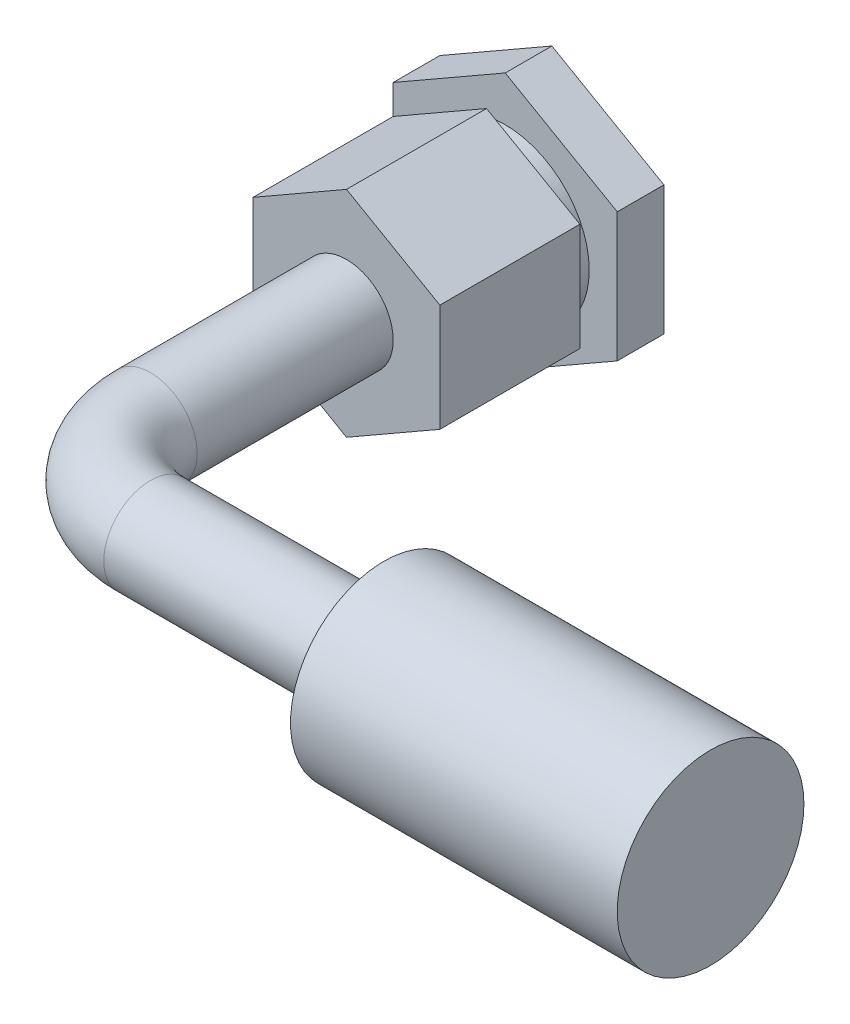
ISO-10303-21;
HEADER;
FILE_DESCRIPTION(('STEP AP214'),'2;1');
FILE_NAME('part.step','',(''),(''),'','','');
FILE_SCHEMA(('AUTOMOTIVE_DESIGN { 1 0 10303 214 1 1 1 1 }'));
ENDSEC;
DATA;
#1=APPLICATION_CONTEXT('core data for automotive mechanical design processes');
#2=APPLICATION_PROTOCOL_DEFINITION('international standard','automotive_design',2000,#1);
#3=PRODUCT_CONTEXT('',#1,'mechanical');
#4=PRODUCT('Part','Part','',(#3));
#5=PRODUCT_RELATED_PRODUCT_CATEGORY('part','',(#4));
#6=PRODUCT_DEFINITION_FORMATION('','',#4);
#7=PRODUCT_DEFINITION_CONTEXT('part definition',#1,'design');
#8=PRODUCT_DEFINITION('design','',#6,#7);
#9=PRODUCT_DEFINITION_SHAPE('','',#8);
#10=(LENGTH_UNIT() NAMED_UNIT(*) SI_UNIT(.MILLI.,.METRE.));
#11=(NAMED_UNIT(*) PLANE_ANGLE_UNIT() SI_UNIT($,.RADIAN.));
#12=(NAMED_UNIT(*) SI_UNIT($,.STERADIAN.) SOLID_ANGLE_UNIT());
#13=UNCERTAINTY_MEASURE_WITH_UNIT(LENGTH_MEASURE(1.E-05),#10,'distance_accuracy_value','');
#14=(GEOMETRIC_REPRESENTATION_CONTEXT(3) GLOBAL_UNCERTAINTY_ASSIGNED_CONTEXT((#13)) GLOBAL_UNIT_ASSIGNED_CONTEXT((#10,
#11,#12)) REPRESENTATION_CONTEXT('',''));
#15=CARTESIAN_POINT('',(0.,0.,0.));
#16=DIRECTION('',(0.,0.,1.));
#17=DIRECTION('',(1.,0.,0.));
#18=AXIS2_PLACEMENT_3D('',#15,#16,#17);
#19=CARTESIAN_POINT('',(-12.,6.91694403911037,5.));
#20=DIRECTION('',(0.,0.,1.));
#21=DIRECTION('',(1.,0.,0.));
#22=AXIS2_PLACEMENT_3D('',#19,#20,#21);
#23=PLANE('',#22);
#24=DIRECTION('',(-0.867435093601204,-0.497550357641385,0.));
#25=VECTOR('',#24,1.);
#26=CARTESIAN_POINT('',(0.,13.8,5.));
#27=LINE('',#26,#25);
#28=CARTESIAN_POINT('',(0.,13.8,5.));
#29=VERTEX_POINT('',#28);
#30=CARTESIAN_POINT('',(-12.,6.91694403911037,5.));
#31=VERTEX_POINT('',#30);
#32=EDGE_CURVE('E206',#29,#31,#27,.T.);
#33=ORIENTED_EDGE('',*,*,#32,.T.);
#34=DIRECTION('',(0.,-1.,0.));
#35=VECTOR('',#34,1.);
#36=CARTESIAN_POINT('',(-12.,6.91694403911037,5.));
#37=LINE('',#36,#35);
#38=CARTESIAN_POINT('',(-12.,-6.91694403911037,5.));
#39=VERTEX_POINT('',#38);
#40=EDGE_CURVE('E208',#31,#39,#37,.T.);
#41=ORIENTED_EDGE('',*,*,#40,.T.);
#42=DIRECTION('',(0.867435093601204,-0.497550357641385,0.));
#43=VECTOR('',#42,1.);
#44=CARTESIAN_POINT('',(0.,-13.8,5.));
#45=LINE('',#44,#43);
#46=CARTESIAN_POINT('',(0.,-13.8,5.));
#47=VERTEX_POINT('',#46);
#48=EDGE_CURVE('E210',#39,#47,#45,.T.);
#49=ORIENTED_EDGE('',*,*,#48,.T.);
#50=DIRECTION('',(0.867435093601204,0.497550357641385,0.));
#51=VECTOR('',#50,1.);
#52=CARTESIAN_POINT('',(0.,-13.8,5.));
#53=LINE('',#52,#51);
#54=CARTESIAN_POINT('',(12.,-6.91694403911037,5.));
#55=VERTEX_POINT('',#54);
#56=EDGE_CURVE('E212',#47,#55,#53,.T.);
#57=ORIENTED_EDGE('',*,*,#56,.T.);
#58=DIRECTION('',(0.,1.,0.));
#59=VECTOR('',#58,1.);
#60=CARTESIAN_POINT('',(12.,6.91694403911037,5.));
#61=LINE('',#60,#59);
#62=CARTESIAN_POINT('',(12.,6.91694403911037,5.));
#63=VERTEX_POINT('',#62);
#64=EDGE_CURVE('E53',#55,#63,#61,.T.);
#65=ORIENTED_EDGE('',*,*,#64,.T.);
#66=DIRECTION('',(-0.867435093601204,0.497550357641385,0.));
#67=VECTOR('',#66,1.);
#68=CARTESIAN_POINT('',(0.,13.8,5.));
#69=LINE('',#68,#67);
#70=EDGE_CURVE('E48',#63,#29,#69,.T.);
#71=ORIENTED_EDGE('',*,*,#70,.T.);
#72=EDGE_LOOP('',(#33,#41,#49,#57,#65,#71));
#73=FACE_BOUND('',#72,.T.);
#74=CARTESIAN_POINT('',(0.,0.,5.));
#75=DIRECTION('',(0.,0.,1.));
#76=DIRECTION('',(1.,0.,0.));
#77=AXIS2_PLACEMENT_3D('',#74,#75,#76);
#78=CIRCLE('',#77,9.);
#79=CARTESIAN_POINT('',(9.,0.,5.));
#80=VERTEX_POINT('',#79);
#81=EDGE_CURVE('E190',#80,#80,#78,.F.);
#82=ORIENTED_EDGE('',*,*,#81,.T.);
#83=EDGE_LOOP('',(#82));
#84=FACE_BOUND('',#83,.T.);
#85=ADVANCED_FACE('F31',(#73,#84),#23,.T.);
#86=CARTESIAN_POINT('',(-12.,6.91694403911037,0.));
#87=DIRECTION('',(0.,0.,1.));
#88=DIRECTION('',(1.,0.,0.));
#89=AXIS2_PLACEMENT_3D('',#86,#87,#88);
#90=PLANE('',#89);
#91=DIRECTION('',(-0.867435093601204,-0.497550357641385,0.));
#92=VECTOR('',#91,1.);
#93=CARTESIAN_POINT('',(0.,13.8,0.));
#94=LINE('',#93,#92);
#95=CARTESIAN_POINT('',(0.,13.8,0.));
#96=VERTEX_POINT('',#95);
#97=CARTESIAN_POINT('',(-12.,6.91694403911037,0.));
#98=VERTEX_POINT('',#97);
#99=EDGE_CURVE('E193',#96,#98,#94,.T.);
#100=ORIENTED_EDGE('',*,*,#99,.F.);
#101=DIRECTION('',(-0.867435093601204,0.497550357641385,0.));
#102=VECTOR('',#101,1.);
#103=CARTESIAN_POINT('',(0.,13.8,0.));
#104=LINE('',#103,#102);
#105=CARTESIAN_POINT('',(12.,6.91694403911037,0.));
#106=VERTEX_POINT('',#105);
#107=EDGE_CURVE('E204',#106,#96,#104,.T.);
#108=ORIENTED_EDGE('',*,*,#107,.F.);
#109=DIRECTION('',(0.,1.,0.));
#110=VECTOR('',#109,1.);
#111=CARTESIAN_POINT('',(12.,6.91694403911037,0.));
#112=LINE('',#111,#110);
#113=CARTESIAN_POINT('',(12.,-6.91694403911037,0.));
#114=VERTEX_POINT('',#113);
#115=EDGE_CURVE('E202',#114,#106,#112,.T.);
#116=ORIENTED_EDGE('',*,*,#115,.F.);
#117=DIRECTION('',(0.867435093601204,0.497550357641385,0.));
#118=VECTOR('',#117,1.);
#119=CARTESIAN_POINT('',(0.,-13.8,0.));
#120=LINE('',#119,#118);
#121=CARTESIAN_POINT('',(0.,-13.8,0.));
#122=VERTEX_POINT('',#121);
#123=EDGE_CURVE('E200',#122,#114,#120,.T.);
#124=ORIENTED_EDGE('',*,*,#123,.F.);
#125=DIRECTION('',(0.867435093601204,-0.497550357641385,0.));
#126=VECTOR('',#125,1.);
#127=CARTESIAN_POINT('',(0.,-13.8,0.));
#128=LINE('',#127,#126);
#129=CARTESIAN_POINT('',(-12.,-6.91694403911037,0.));
#130=VERTEX_POINT('',#129);
#131=EDGE_CURVE('E198',#130,#122,#128,.T.);
#132=ORIENTED_EDGE('',*,*,#131,.F.);
#133=DIRECTION('',(0.,-1.,0.));
#134=VECTOR('',#133,1.);
#135=CARTESIAN_POINT('',(-12.,6.91694403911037,0.));
#136=LINE('',#135,#134);
#137=EDGE_CURVE('E196',#98,#130,#136,.T.);
#138=ORIENTED_EDGE('',*,*,#137,.F.);
#139=EDGE_LOOP('',(#100,#108,#116,#124,#132,#138));
#140=FACE_BOUND('',#139,.T.);
#141=CARTESIAN_POINT('',(0.,0.,0.));
#142=DIRECTION('',(0.,0.,1.));
#143=DIRECTION('',(1.,0.,0.));
#144=AXIS2_PLACEMENT_3D('',#141,#142,#143);
#145=CIRCLE('',#144,9.);
#146=CARTESIAN_POINT('',(9.,0.,0.));
#147=VERTEX_POINT('',#146);
#148=EDGE_CURVE('E35',#147,#147,#145,.F.);
#149=ORIENTED_EDGE('',*,*,#148,.F.);
#150=EDGE_LOOP('',(#149));
#151=FACE_BOUND('',#150,.T.);
#152=ADVANCED_FACE('F239',(#140,#151),#90,.F.);
#153=CARTESIAN_POINT('',(0.,13.8,5.));
#154=DIRECTION('',(0.497550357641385,-0.867435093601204,0.));
#155=DIRECTION('',(0.867435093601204,0.497550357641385,0.));
#156=AXIS2_PLACEMENT_3D('',#153,#154,#155);
#157=PLANE('',#156);
#158=ORIENTED_EDGE('',*,*,#99,.T.);
#159=DIRECTION('',(0.,0.,-1.));
#160=VECTOR('',#159,1.);
#161=CARTESIAN_POINT('',(-12.,6.91694403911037,5.));
#162=LINE('',#161,#160);
#163=EDGE_CURVE('E230',#31,#98,#162,.T.);
#164=ORIENTED_EDGE('',*,*,#163,.F.);
#165=ORIENTED_EDGE('',*,*,#32,.F.);
#166=DIRECTION('',(0.,0.,-1.));
#167=VECTOR('',#166,1.);
#168=CARTESIAN_POINT('',(0.,13.8,5.));
#169=LINE('',#168,#167);
#170=EDGE_CURVE('E216',#29,#96,#169,.T.);
#171=ORIENTED_EDGE('',*,*,#170,.T.);
#172=EDGE_LOOP('',(#158,#164,#165,#171));
#173=FACE_BOUND('',#172,.T.);
#174=ADVANCED_FACE('F33',(#173),#157,.F.);
#175=CARTESIAN_POINT('',(-12.,6.91694403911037,5.));
#176=DIRECTION('',(1.,0.,0.));
#177=DIRECTION('',(0.,0.,-1.));
#178=AXIS2_PLACEMENT_3D('',#175,#176,#177);
#179=PLANE('',#178);
#180=ORIENTED_EDGE('',*,*,#137,.T.);
#181=DIRECTION('',(0.,0.,-1.));
#182=VECTOR('',#181,1.);
#183=CARTESIAN_POINT('',(-12.,-6.91694403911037,5.));
#184=LINE('',#183,#182);
#185=EDGE_CURVE('E228',#39,#130,#184,.T.);
#186=ORIENTED_EDGE('',*,*,#185,.F.);
#187=ORIENTED_EDGE('',*,*,#40,.F.);
#188=ORIENTED_EDGE('',*,*,#163,.T.);
#189=EDGE_LOOP('',(#180,#186,#187,#188));
#190=FACE_BOUND('',#189,.T.);
#191=ADVANCED_FACE('F247',(#190),#179,.F.);
#192=CARTESIAN_POINT('',(0.,-13.8,5.));
#193=DIRECTION('',(0.497550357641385,0.867435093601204,0.));
#194=DIRECTION('',(-0.867435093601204,0.497550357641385,0.));
#195=AXIS2_PLACEMENT_3D('',#192,#193,#194);
#196=PLANE('',#195);
#197=ORIENTED_EDGE('',*,*,#131,.T.);
#198=DIRECTION('',(0.,0.,-1.));
#199=VECTOR('',#198,1.);
#200=CARTESIAN_POINT('',(0.,-13.8,5.));
#201=LINE('',#200,#199);
#202=EDGE_CURVE('E225',#47,#122,#201,.T.);
#203=ORIENTED_EDGE('',*,*,#202,.F.);
#204=ORIENTED_EDGE('',*,*,#48,.F.);
#205=ORIENTED_EDGE('',*,*,#185,.T.);
#206=EDGE_LOOP('',(#197,#203,#204,#205));
#207=FACE_BOUND('',#206,.T.);
#208=ADVANCED_FACE('F267',(#207),#196,.F.);
#209=CARTESIAN_POINT('',(0.,-13.8,5.));
#210=DIRECTION('',(-0.497550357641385,0.867435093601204,0.));
#211=DIRECTION('',(-0.867435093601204,-0.497550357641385,0.));
#212=AXIS2_PLACEMENT_3D('',#209,#210,#211);
#213=PLANE('',#212);
#214=ORIENTED_EDGE('',*,*,#123,.T.);
#215=DIRECTION('',(0.,0.,-1.));
#216=VECTOR('',#215,1.);
#217=CARTESIAN_POINT('',(12.,-6.91694403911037,5.));
#218=LINE('',#217,#216);
#219=EDGE_CURVE('E222',#55,#114,#218,.T.);
#220=ORIENTED_EDGE('',*,*,#219,.F.);
#221=ORIENTED_EDGE('',*,*,#56,.F.);
#222=ORIENTED_EDGE('',*,*,#202,.T.);
#223=EDGE_LOOP('',(#214,#220,#221,#222));
#224=FACE_BOUND('',#223,.T.);
#225=ADVANCED_FACE('F263',(#224),#213,.F.);
#226=CARTESIAN_POINT('',(12.,6.91694403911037,5.));
#227=DIRECTION('',(-1.,0.,0.));
#228=DIRECTION('',(0.,0.,1.));
#229=AXIS2_PLACEMENT_3D('',#226,#227,#228);
#230=PLANE('',#229);
#231=ORIENTED_EDGE('',*,*,#115,.T.);
#232=DIRECTION('',(0.,0.,-1.));
#233=VECTOR('',#232,1.);
#234=CARTESIAN_POINT('',(12.,6.91694403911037,5.));
#235=LINE('',#234,#233);
#236=EDGE_CURVE('E219',#63,#106,#235,.T.);
#237=ORIENTED_EDGE('',*,*,#236,.F.);
#238=ORIENTED_EDGE('',*,*,#64,.F.);
#239=ORIENTED_EDGE('',*,*,#219,.T.);
#240=EDGE_LOOP('',(#231,#237,#238,#239));
#241=FACE_BOUND('',#240,.T.);
#242=ADVANCED_FACE('F259',(#241),#230,.F.);
#243=CARTESIAN_POINT('',(0.,13.8,5.));
#244=DIRECTION('',(-0.497550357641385,-0.867435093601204,0.));
#245=DIRECTION('',(0.867435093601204,-0.497550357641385,0.));
#246=AXIS2_PLACEMENT_3D('',#243,#244,#245);
#247=PLANE('',#246);
#248=ORIENTED_EDGE('',*,*,#107,.T.);
#249=ORIENTED_EDGE('',*,*,#170,.F.);
#250=ORIENTED_EDGE('',*,*,#70,.F.);
#251=ORIENTED_EDGE('',*,*,#236,.T.);
#252=EDGE_LOOP('',(#248,#249,#250,#251));
#253=FACE_BOUND('',#252,.T.);
#254=ADVANCED_FACE('F255',(#253),#247,.F.);
#255=CARTESIAN_POINT('',(0.,0.,-2.));
#256=DIRECTION('',(0.,0.,1.));
#257=DIRECTION('',(1.,0.,0.));
#258=AXIS2_PLACEMENT_3D('',#255,#256,#257);
#259=PLANE('',#258);
#260=CARTESIAN_POINT('',(0.,0.,-2.));
#261=DIRECTION('',(0.,0.,1.));
#262=DIRECTION('',(1.,0.,0.));
#263=AXIS2_PLACEMENT_3D('',#260,#261,#262);
#264=CIRCLE('',#263,9.);
#265=CARTESIAN_POINT('',(9.,0.,-2.));
#266=VERTEX_POINT('',#265);
#267=EDGE_CURVE('E142',#266,#266,#264,.T.);
#268=ORIENTED_EDGE('',*,*,#267,.F.);
#269=EDGE_LOOP('',(#268));
#270=FACE_BOUND('',#269,.T.);
#271=ADVANCED_FACE('F258',(#270),#259,.F.);
#272=CARTESIAN_POINT('',(0.,0.,7.));
#273=DIRECTION('',(0.,0.,-1.));
#274=DIRECTION('',(-1.,0.,0.));
#275=AXIS2_PLACEMENT_3D('',#272,#273,#274);
#276=CYLINDRICAL_SURFACE('',#275,9.);
#277=ORIENTED_EDGE('',*,*,#267,.T.);
#278=EDGE_LOOP('',(#277));
#279=FACE_BOUND('',#278,.T.);
#280=ORIENTED_EDGE('',*,*,#148,.T.);
#281=EDGE_LOOP('',(#280));
#282=FACE_BOUND('',#281,.T.);
#283=ADVANCED_FACE('F237',(#279,#282),#276,.T.);
#284=ORIENTED_EDGE('',*,*,#81,.F.);
#285=EDGE_LOOP('',(#284));
#286=FACE_BOUND('',#285,.T.);
#287=CARTESIAN_POINT('',(0.,0.,7.));
#288=DIRECTION('',(0.,0.,1.));
#289=DIRECTION('',(1.,0.,0.));
#290=AXIS2_PLACEMENT_3D('',#287,#288,#289);
#291=CIRCLE('',#290,9.);
#292=CARTESIAN_POINT('',(9.,0.,7.));
#293=VERTEX_POINT('',#292);
#294=EDGE_CURVE('E187',#293,#293,#291,.T.);
#295=ORIENTED_EDGE('',*,*,#294,.F.);
#296=EDGE_LOOP('',(#295));
#297=FACE_BOUND('',#296,.T.);
#298=ADVANCED_FACE('F252',(#286,#297),#276,.T.);
#299=CARTESIAN_POINT('',(-10.,5.76412003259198,7.));
#300=DIRECTION('',(0.,0.,1.));
#301=DIRECTION('',(1.,0.,0.));
#302=AXIS2_PLACEMENT_3D('',#299,#300,#301);
#303=PLANE('',#302);
#304=DIRECTION('',(-0.867435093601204,-0.497550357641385,0.));
#305=VECTOR('',#304,1.);
#306=CARTESIAN_POINT('',(0.,11.5,7.));
#307=LINE('',#306,#305);
#308=CARTESIAN_POINT('',(0.,11.5,7.));
#309=VERTEX_POINT('',#308);
#310=CARTESIAN_POINT('',(-10.,5.76412003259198,7.));
#311=VERTEX_POINT('',#310);
#312=EDGE_CURVE('E128',#309,#311,#307,.T.);
#313=ORIENTED_EDGE('',*,*,#312,.F.);
#314=DIRECTION('',(-0.867435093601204,0.497550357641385,0.));
#315=VECTOR('',#314,1.);
#316=CARTESIAN_POINT('',(0.,11.5,7.));
#317=LINE('',#316,#315);
#318=CARTESIAN_POINT('',(10.,5.76412003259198,7.));
#319=VERTEX_POINT('',#318);
#320=EDGE_CURVE('E161',#319,#309,#317,.T.);
#321=ORIENTED_EDGE('',*,*,#320,.F.);
#322=DIRECTION('',(0.,1.,0.));
#323=VECTOR('',#322,1.);
#324=CARTESIAN_POINT('',(10.,5.76412003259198,7.));
#325=LINE('',#324,#323);
#326=CARTESIAN_POINT('',(10.,-5.76412003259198,7.));
#327=VERTEX_POINT('',#326);
#328=EDGE_CURVE('E159',#327,#319,#325,.T.);
#329=ORIENTED_EDGE('',*,*,#328,.F.);
#330=DIRECTION('',(0.867435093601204,0.497550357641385,0.));
#331=VECTOR('',#330,1.);
#332=CARTESIAN_POINT('',(0.,-11.5,7.));
#333=LINE('',#332,#331);
#334=CARTESIAN_POINT('',(0.,-11.5,7.));
#335=VERTEX_POINT('',#334);
#336=EDGE_CURVE('E157',#335,#327,#333,.T.);
#337=ORIENTED_EDGE('',*,*,#336,.F.);
#338=DIRECTION('',(0.867435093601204,-0.497550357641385,0.));
#339=VECTOR('',#338,1.);
#340=CARTESIAN_POINT('',(0.,-11.5,7.));
#341=LINE('',#340,#339);
#342=CARTESIAN_POINT('',(-10.,-5.76412003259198,7.));
#343=VERTEX_POINT('',#342);
#344=EDGE_CURVE('E130',#343,#335,#341,.T.);
#345=ORIENTED_EDGE('',*,*,#344,.F.);
#346=DIRECTION('',(0.,-1.,0.));
#347=VECTOR('',#346,1.);
#348=CARTESIAN_POINT('',(-10.,5.76412003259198,7.));
#349=LINE('',#348,#347);
#350=EDGE_CURVE('E122',#311,#343,#349,.T.);
#351=ORIENTED_EDGE('',*,*,#350,.F.);
#352=EDGE_LOOP('',(#313,#321,#329,#337,#345,#351));
#353=FACE_BOUND('',#352,.T.);
#354=ORIENTED_EDGE('',*,*,#294,.T.);
#355=EDGE_LOOP('',(#354));
#356=FACE_BOUND('',#355,.T.);
#357=ADVANCED_FACE('F124',(#353,#356),#303,.F.);
#358=CARTESIAN_POINT('',(0.,11.5,22.));
#359=DIRECTION('',(0.497550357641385,-0.867435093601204,0.));
#360=DIRECTION('',(0.867435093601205,0.497550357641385,0.));
#361=AXIS2_PLACEMENT_3D('',#358,#359,#360);
#362=PLANE('',#361);
#363=ORIENTED_EDGE('',*,*,#312,.T.);
#364=DIRECTION('',(0.,0.,-1.));
#365=VECTOR('',#364,1.);
#366=CARTESIAN_POINT('',(-10.,5.76412003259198,22.));
#367=LINE('',#366,#365);
#368=CARTESIAN_POINT('',(-10.,5.76412003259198,22.));
#369=VERTEX_POINT('',#368);
#370=EDGE_CURVE('E136',#369,#311,#367,.T.);
#371=ORIENTED_EDGE('',*,*,#370,.F.);
#372=DIRECTION('',(-0.867435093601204,-0.497550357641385,0.));
#373=VECTOR('',#372,1.);
#374=CARTESIAN_POINT('',(0.,11.5,22.));
#375=LINE('',#374,#373);
#376=CARTESIAN_POINT('',(0.,11.5,22.));
#377=VERTEX_POINT('',#376);
#378=EDGE_CURVE('E163',#377,#369,#375,.T.);
#379=ORIENTED_EDGE('',*,*,#378,.F.);
#380=DIRECTION('',(0.,0.,-1.));
#381=VECTOR('',#380,1.);
#382=CARTESIAN_POINT('',(0.,11.5,22.));
#383=LINE('',#382,#381);
#384=EDGE_CURVE('E148',#377,#309,#383,.T.);
#385=ORIENTED_EDGE('',*,*,#384,.T.);
#386=EDGE_LOOP('',(#363,#371,#379,#385));
#387=FACE_BOUND('',#386,.T.);
#388=ADVANCED_FACE('F146',(#387),#362,.F.);
#389=CARTESIAN_POINT('',(-10.,5.76412003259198,22.));
#390=DIRECTION('',(1.,0.,0.));
#391=DIRECTION('',(0.,0.,-1.));
#392=AXIS2_PLACEMENT_3D('',#389,#390,#391);
#393=PLANE('',#392);
#394=ORIENTED_EDGE('',*,*,#350,.T.);
#395=DIRECTION('',(0.,0.,-1.));
#396=VECTOR('',#395,1.);
#397=CARTESIAN_POINT('',(-10.,-5.76412003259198,22.));
#398=LINE('',#397,#396);
#399=CARTESIAN_POINT('',(-10.,-5.76412003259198,22.));
#400=VERTEX_POINT('',#399);
#401=EDGE_CURVE('E143',#400,#343,#398,.T.);
#402=ORIENTED_EDGE('',*,*,#401,.F.);
#403=DIRECTION('',(0.,-1.,0.));
#404=VECTOR('',#403,1.);
#405=CARTESIAN_POINT('',(-10.,5.76412003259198,22.));
#406=LINE('',#405,#404);
#407=EDGE_CURVE('E138',#369,#400,#406,.T.);
#408=ORIENTED_EDGE('',*,*,#407,.F.);
#409=ORIENTED_EDGE('',*,*,#370,.T.);
#410=EDGE_LOOP('',(#394,#402,#408,#409));
#411=FACE_BOUND('',#410,.T.);
#412=ADVANCED_FACE('F137',(#411),#393,.F.);
#413=CARTESIAN_POINT('',(0.,-11.5,22.));
#414=DIRECTION('',(0.497550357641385,0.867435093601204,0.));
#415=DIRECTION('',(-0.867435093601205,0.497550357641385,0.));
#416=AXIS2_PLACEMENT_3D('',#413,#414,#415);
#417=PLANE('',#416);
#418=ORIENTED_EDGE('',*,*,#344,.T.);
#419=DIRECTION('',(0.,0.,-1.));
#420=VECTOR('',#419,1.);
#421=CARTESIAN_POINT('',(0.,-11.5,22.));
#422=LINE('',#421,#420);
#423=CARTESIAN_POINT('',(0.,-11.5,22.));
#424=VERTEX_POINT('',#423);
#425=EDGE_CURVE('E181',#424,#335,#422,.T.);
#426=ORIENTED_EDGE('',*,*,#425,.F.);
#427=DIRECTION('',(0.867435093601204,-0.497550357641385,0.));
#428=VECTOR('',#427,1.);
#429=CARTESIAN_POINT('',(0.,-11.5,22.));
#430=LINE('',#429,#428);
#431=EDGE_CURVE('E166',#400,#424,#430,.T.);
#432=ORIENTED_EDGE('',*,*,#431,.F.);
#433=ORIENTED_EDGE('',*,*,#401,.T.);
#434=EDGE_LOOP('',(#418,#426,#432,#433));
#435=FACE_BOUND('',#434,.T.);
#436=ADVANCED_FACE('F316',(#435),#417,.F.);
#437=CARTESIAN_POINT('',(0.,-11.5,22.));
#438=DIRECTION('',(-0.497550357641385,0.867435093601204,0.));
#439=DIRECTION('',(-0.867435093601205,-0.497550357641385,0.));
#440=AXIS2_PLACEMENT_3D('',#437,#438,#439);
#441=PLANE('',#440);
#442=ORIENTED_EDGE('',*,*,#336,.T.);
#443=DIRECTION('',(0.,0.,-1.));
#444=VECTOR('',#443,1.);
#445=CARTESIAN_POINT('',(10.,-5.76412003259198,22.));
#446=LINE('',#445,#444);
#447=CARTESIAN_POINT('',(10.,-5.76412003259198,22.));
#448=VERTEX_POINT('',#447);
#449=EDGE_CURVE('E178',#448,#327,#446,.T.);
#450=ORIENTED_EDGE('',*,*,#449,.F.);
#451=DIRECTION('',(0.867435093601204,0.497550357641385,0.));
#452=VECTOR('',#451,1.);
#453=CARTESIAN_POINT('',(0.,-11.5,22.));
#454=LINE('',#453,#452);
#455=EDGE_CURVE('E168',#424,#448,#454,.T.);
#456=ORIENTED_EDGE('',*,*,#455,.F.);
#457=ORIENTED_EDGE('',*,*,#425,.T.);
#458=EDGE_LOOP('',(#442,#450,#456,#457));
#459=FACE_BOUND('',#458,.T.);
#460=ADVANCED_FACE('F312',(#459),#441,.F.);
#461=CARTESIAN_POINT('',(10.,5.76412003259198,22.));
#462=DIRECTION('',(-1.,0.,0.));
#463=DIRECTION('',(0.,0.,1.));
#464=AXIS2_PLACEMENT_3D('',#461,#462,#463);
#465=PLANE('',#464);
#466=ORIENTED_EDGE('',*,*,#328,.T.);
#467=DIRECTION('',(0.,0.,-1.));
#468=VECTOR('',#467,1.);
#469=CARTESIAN_POINT('',(10.,5.76412003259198,22.));
#470=LINE('',#469,#468);
#471=CARTESIAN_POINT('',(10.,5.76412003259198,22.));
#472=VERTEX_POINT('',#471);
#473=EDGE_CURVE('E175',#472,#319,#470,.T.);
#474=ORIENTED_EDGE('',*,*,#473,.F.);
#475=DIRECTION('',(0.,1.,0.));
#476=VECTOR('',#475,1.);
#477=CARTESIAN_POINT('',(10.,5.76412003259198,22.));
#478=LINE('',#477,#476);
#479=EDGE_CURVE('E170',#448,#472,#478,.T.);
#480=ORIENTED_EDGE('',*,*,#479,.F.);
#481=ORIENTED_EDGE('',*,*,#449,.T.);
#482=EDGE_LOOP('',(#466,#474,#480,#481));
#483=FACE_BOUND('',#482,.T.);
#484=ADVANCED_FACE('F308',(#483),#465,.F.);
#485=CARTESIAN_POINT('',(0.,11.5,22.));
#486=DIRECTION('',(-0.497550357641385,-0.867435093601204,0.));
#487=DIRECTION('',(0.867435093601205,-0.497550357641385,0.));
#488=AXIS2_PLACEMENT_3D('',#485,#486,#487);
#489=PLANE('',#488);
#490=ORIENTED_EDGE('',*,*,#320,.T.);
#491=ORIENTED_EDGE('',*,*,#384,.F.);
#492=DIRECTION('',(-0.867435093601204,0.497550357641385,0.));
#493=VECTOR('',#492,1.);
#494=CARTESIAN_POINT('',(0.,11.5,22.));
#495=LINE('',#494,#493);
#496=EDGE_CURVE('E172',#472,#377,#495,.T.);
#497=ORIENTED_EDGE('',*,*,#496,.F.);
#498=ORIENTED_EDGE('',*,*,#473,.T.);
#499=EDGE_LOOP('',(#490,#491,#497,#498));
#500=FACE_BOUND('',#499,.T.);
#501=ADVANCED_FACE('F303',(#500),#489,.F.);
#502=CARTESIAN_POINT('',(-10.,5.76412003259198,22.));
#503=DIRECTION('',(0.,0.,1.));
#504=DIRECTION('',(1.,0.,0.));
#505=AXIS2_PLACEMENT_3D('',#502,#503,#504);
#506=PLANE('',#505);
#507=CARTESIAN_POINT('',(0.,0.,22.));
#508=DIRECTION('',(0.,0.,1.));
#509=DIRECTION('',(1.,0.,0.));
#510=AXIS2_PLACEMENT_3D('',#507,#508,#509);
#511=CIRCLE('',#510,5.);
#512=CARTESIAN_POINT('',(5.,0.,22.));
#513=VERTEX_POINT('',#512);
#514=EDGE_CURVE('E11',#513,#513,#511,.T.);
#515=ORIENTED_EDGE('',*,*,#514,.F.);
#516=EDGE_LOOP('',(#515));
#517=FACE_BOUND('',#516,.T.);
#518=ORIENTED_EDGE('',*,*,#378,.T.);
#519=ORIENTED_EDGE('',*,*,#407,.T.);
#520=ORIENTED_EDGE('',*,*,#431,.T.);
#521=ORIENTED_EDGE('',*,*,#455,.T.);
#522=ORIENTED_EDGE('',*,*,#479,.T.);
#523=ORIENTED_EDGE('',*,*,#496,.T.);
#524=EDGE_LOOP('',(#518,#519,#520,#521,#522,#523));
#525=FACE_BOUND('',#524,.T.);
#526=ADVANCED_FACE('F300',(#517,#525),#506,.T.);
#527=CARTESIAN_POINT('',(10.,0.,53.));
#528=DIRECTION('',(1.,0.,0.));
#529=DIRECTION('',(0.,0.,-1.));
#530=AXIS2_PLACEMENT_3D('',#527,#528,#529);
#531=CYLINDRICAL_SURFACE('',#530,5.);
#532=CARTESIAN_POINT('',(10.,0.,53.));
#533=DIRECTION('',(1.,0.,0.));
#534=DIRECTION('',(0.,0.,-1.));
#535=AXIS2_PLACEMENT_3D('',#532,#533,#534);
#536=CIRCLE('',#535,5.);
#537=CARTESIAN_POINT('',(10.,0.,58.));
#538=VERTEX_POINT('',#537);
#539=EDGE_CURVE('E152',#538,#538,#536,.T.);
#540=ORIENTED_EDGE('',*,*,#539,.T.);
#541=EDGE_LOOP('',(#540));
#542=FACE_BOUND('',#541,.T.);
#543=CARTESIAN_POINT('',(35.,0.,53.));
#544=DIRECTION('',(1.,0.,0.));
#545=DIRECTION('',(0.,0.,-1.));
#546=AXIS2_PLACEMENT_3D('',#543,#544,#545);
#547=CIRCLE('',#546,5.);
#548=CARTESIAN_POINT('',(35.,0.,48.));
#549=VERTEX_POINT('',#548);
#550=EDGE_CURVE('E149',#549,#549,#547,.T.);
#551=ORIENTED_EDGE('',*,*,#550,.F.);
#552=EDGE_LOOP('',(#551));
#553=FACE_BOUND('',#552,.T.);
#554=ADVANCED_FACE('F298',(#542,#553),#531,.T.);
#555=CARTESIAN_POINT('',(10.,0.,43.));
#556=DIRECTION('',(0.,1.,0.));
#557=DIRECTION('',(0.,0.,1.));
#558=AXIS2_PLACEMENT_3D('',#555,#556,#557);
#559=TOROIDAL_SURFACE('',#558,10.,5.);
#560=CARTESIAN_POINT('',(0.,0.,43.));
#561=DIRECTION('',(0.,0.,1.));
#562=DIRECTION('',(1.,0.,0.));
#563=AXIS2_PLACEMENT_3D('',#560,#561,#562);
#564=CIRCLE('',#563,5.);
#565=CARTESIAN_POINT('',(-5.,0.,43.));
#566=VERTEX_POINT('',#565);
#567=EDGE_CURVE('E508',#566,#566,#564,.T.);
#568=CARTESIAN_POINT('',(10.,0.,43.));
#569=DIRECTION('',(0.,1.,0.));
#570=DIRECTION('',(0.,0.,1.));
#571=AXIS2_PLACEMENT_3D('',#568,#569,#570);
#572=CIRCLE('',#571,15.);
#573=EDGE_CURVE('',#566,#538,#572,.T.);
#574=ORIENTED_EDGE('',*,*,#567,.T.);
#575=ORIENTED_EDGE('',*,*,#539,.F.);
#576=ORIENTED_EDGE('',*,*,#573,.T.);
#577=ORIENTED_EDGE('',*,*,#573,.F.);
#578=EDGE_LOOP('',(#574,#576,#575,#577));
#579=FACE_BOUND('',#578,.T.);
#580=ADVANCED_FACE('F391',(#579),#559,.T.);
#581=CARTESIAN_POINT('',(0.,0.,43.));
#582=DIRECTION('',(0.,0.,-1.));
#583=DIRECTION('',(-1.,0.,0.));
#584=AXIS2_PLACEMENT_3D('',#581,#582,#583);
#585=CYLINDRICAL_SURFACE('',#584,5.);
#586=ORIENTED_EDGE('',*,*,#567,.F.);
#587=EDGE_LOOP('',(#586));
#588=FACE_BOUND('',#587,.T.);
#589=ORIENTED_EDGE('',*,*,#514,.T.);
#590=EDGE_LOOP('',(#589));
#591=FACE_BOUND('',#590,.T.);
#592=ADVANCED_FACE('F400',(#588,#591),#585,.T.);
#593=CARTESIAN_POINT('',(70.,0.,53.));
#594=DIRECTION('',(-1.,0.,0.));
#595=DIRECTION('',(0.,0.,1.));
#596=AXIS2_PLACEMENT_3D('',#593,#594,#595);
#597=CYLINDRICAL_SURFACE('',#596,10.);
#598=CARTESIAN_POINT('',(70.,0.,53.));
#599=DIRECTION('',(1.,0.,0.));
#600=DIRECTION('',(0.,0.,-1.));
#601=AXIS2_PLACEMENT_3D('',#598,#599,#600);
#602=CIRCLE('',#601,10.);
#603=CARTESIAN_POINT('',(70.,0.,43.));
#604=VERTEX_POINT('',#603);
#605=EDGE_CURVE('E495',#604,#604,#602,.T.);
#606=ORIENTED_EDGE('',*,*,#605,.F.);
#607=EDGE_LOOP('',(#606));
#608=FACE_BOUND('',#607,.T.);
#609=CARTESIAN_POINT('',(35.,0.,53.));
#610=DIRECTION('',(1.,0.,0.));
#611=DIRECTION('',(0.,0.,-1.));
#612=AXIS2_PLACEMENT_3D('',#609,#610,#611);
#613=CIRCLE('',#612,10.);
#614=CARTESIAN_POINT('',(35.,0.,43.));
#615=VERTEX_POINT('',#614);
#616=EDGE_CURVE('E501',#615,#615,#613,.T.);
#617=ORIENTED_EDGE('',*,*,#616,.T.);
#618=EDGE_LOOP('',(#617));
#619=FACE_BOUND('',#618,.T.);
#620=ADVANCED_FACE('F409',(#608,#619),#597,.T.);
#621=CARTESIAN_POINT('',(70.,0.,53.));
#622=DIRECTION('',(1.,0.,0.));
#623=DIRECTION('',(0.,0.,-1.));
#624=AXIS2_PLACEMENT_3D('',#621,#622,#623);
#625=PLANE('',#624);
#626=ORIENTED_EDGE('',*,*,#605,.T.);
#627=EDGE_LOOP('',(#626));
#628=FACE_BOUND('',#627,.T.);
#629=ADVANCED_FACE('F460',(#628),#625,.T.);
#630=CARTESIAN_POINT('',(35.,0.,53.));
#631=DIRECTION('',(1.,0.,0.));
#632=DIRECTION('',(0.,0.,-1.));
#633=AXIS2_PLACEMENT_3D('',#630,#631,#632);
#634=PLANE('',#633);
#635=ORIENTED_EDGE('',*,*,#550,.T.);
#636=EDGE_LOOP('',(#635));
#637=FACE_BOUND('',#636,.T.);
#638=ORIENTED_EDGE('',*,*,#616,.F.);
#639=EDGE_LOOP('',(#638));
#640=FACE_BOUND('',#639,.T.);
#641=ADVANCED_FACE('F470',(#637,#640),#634,.F.);
#642=CLOSED_SHELL('',(#85,#152,#174,#191,#208,#225,#242,#254,#271,#283,#298,#357,#388,#412,#436,
#460,#484,#501,#526,#554,#580,#592,#620,#629,#641));
#643=CARTESIAN_POINT('',(0.,0.,22.));
#644=DIRECTION('',(0.,0.,1.));
#645=DIRECTION('',(1.,0.,0.));
#646=AXIS2_PLACEMENT_3D('',#643,#644,#645);
#647=CIRCLE('',#646,4.);
#648=CARTESIAN_POINT('',(4.,0.,22.));
#649=VERTEX_POINT('',#648);
#650=EDGE_CURVE('E494',#649,#649,#647,.T.);
#651=ORIENTED_EDGE('',*,*,#650,.T.);
#652=EDGE_LOOP('',(#651));
#653=FACE_BOUND('',#652,.T.);
#654=ADVANCED_FACE('F305',(#653),#506,.T.);
#655=CARTESIAN_POINT('',(0.,0.,43.));
#656=DIRECTION('',(0.,0.,-1.));
#657=DIRECTION('',(-1.,0.,0.));
#658=AXIS2_PLACEMENT_3D('',#655,#656,#657);
#659=CYLINDRICAL_SURFACE('',#658,4.);
#660=CARTESIAN_POINT('',(0.,0.,43.));
#661=DIRECTION('',(0.,0.,-1.));
#662=DIRECTION('',(-1.,0.,0.));
#663=AXIS2_PLACEMENT_3D('',#660,#661,#662);
#664=CIRCLE('',#663,4.);
#665=CARTESIAN_POINT('',(-4.,0.,43.));
#666=VERTEX_POINT('',#665);
#667=EDGE_CURVE('E498',#666,#666,#664,.F.);
#668=ORIENTED_EDGE('',*,*,#667,.T.);
#669=EDGE_LOOP('',(#668));
#670=FACE_BOUND('',#669,.T.);
#671=ORIENTED_EDGE('',*,*,#650,.F.);
#672=EDGE_LOOP('',(#671));
#673=FACE_BOUND('',#672,.T.);
#674=ADVANCED_FACE('F434',(#670,#673),#659,.F.);
#675=CARTESIAN_POINT('',(10.,0.,43.));
#676=DIRECTION('',(0.,1.,0.));
#677=DIRECTION('',(0.,0.,1.));
#678=AXIS2_PLACEMENT_3D('',#675,#676,#677);
#679=TOROIDAL_SURFACE('',#678,10.,4.);
#680=CARTESIAN_POINT('',(10.,0.,53.));
#681=DIRECTION('',(1.,0.,0.));
#682=DIRECTION('',(0.,0.,-1.));
#683=AXIS2_PLACEMENT_3D('',#680,#681,#682);
#684=CIRCLE('',#683,4.);
#685=CARTESIAN_POINT('',(10.,0.,57.));
#686=VERTEX_POINT('',#685);
#687=EDGE_CURVE('E505',#686,#686,#684,.T.);
#688=CARTESIAN_POINT('',(10.,0.,43.));
#689=DIRECTION('',(0.,1.,0.));
#690=DIRECTION('',(0.,0.,1.));
#691=AXIS2_PLACEMENT_3D('',#688,#689,#690);
#692=CIRCLE('',#691,14.);
#693=EDGE_CURVE('',#666,#686,#692,.T.);
#694=ORIENTED_EDGE('',*,*,#667,.F.);
#695=ORIENTED_EDGE('',*,*,#687,.T.);
#696=ORIENTED_EDGE('',*,*,#693,.T.);
#697=ORIENTED_EDGE('',*,*,#693,.F.);
#698=EDGE_LOOP('',(#694,#696,#695,#697));
#699=FACE_BOUND('',#698,.T.);
#700=ADVANCED_FACE('F422',(#699),#679,.F.);
#701=CARTESIAN_POINT('',(10.,0.,53.));
#702=DIRECTION('',(1.,0.,0.));
#703=DIRECTION('',(0.,0.,-1.));
#704=AXIS2_PLACEMENT_3D('',#701,#702,#703);
#705=CYLINDRICAL_SURFACE('',#704,4.);
#706=ORIENTED_EDGE('',*,*,#687,.F.);
#707=EDGE_LOOP('',(#706));
#708=FACE_BOUND('',#707,.T.);
#709=CARTESIAN_POINT('',(35.,0.,53.));
#710=DIRECTION('',(1.,0.,0.));
#711=DIRECTION('',(0.,0.,-1.));
#712=AXIS2_PLACEMENT_3D('',#709,#710,#711);
#713=CIRCLE('',#712,4.);
#714=CARTESIAN_POINT('',(35.,0.,49.));
#715=VERTEX_POINT('',#714);
#716=EDGE_CURVE('E492',#715,#715,#713,.F.);
#717=ORIENTED_EDGE('',*,*,#716,.F.);
#718=EDGE_LOOP('',(#717));
#719=FACE_BOUND('',#718,.T.);
#720=ADVANCED_FACE('F417',(#708,#719),#705,.F.);
#721=ORIENTED_EDGE('',*,*,#716,.T.);
#722=EDGE_LOOP('',(#721));
#723=FACE_BOUND('',#722,.T.);
#724=ADVANCED_FACE('F421',(#723),#634,.F.);
#725=CLOSED_SHELL('',(#654,#674,#700,#720,#724));
#726=ORIENTED_CLOSED_SHELL('',*,#725,.T.);
#727=BREP_WITH_VOIDS('B2',#642,(#726));
#728=ADVANCED_BREP_SHAPE_REPRESENTATION('',(#18,#727),#14);
#729=SHAPE_DEFINITION_REPRESENTATION(#9,#728);
ENDSEC;
END-ISO-10303-21;
